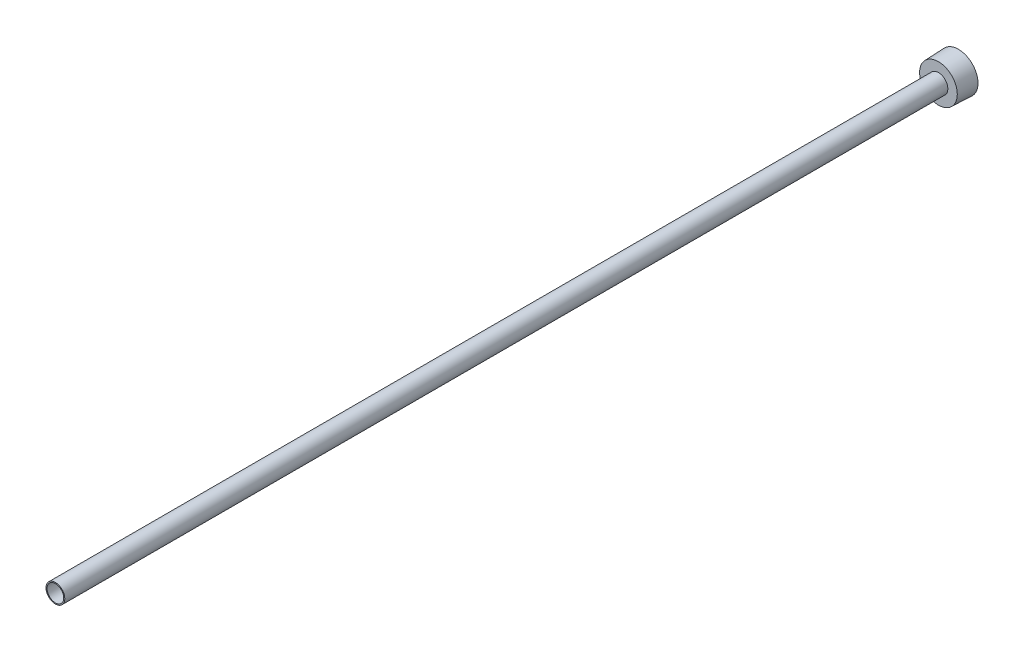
ISO-10303-21;
HEADER;
FILE_DESCRIPTION(('STEP AP214'),'2;1');
FILE_NAME('part.step','',(''),(''),'','','');
FILE_SCHEMA(('AUTOMOTIVE_DESIGN { 1 0 10303 214 1 1 1 1 }'));
ENDSEC;
DATA;
#1=APPLICATION_CONTEXT('core data for automotive mechanical design processes');
#2=APPLICATION_PROTOCOL_DEFINITION('international standard','automotive_design',2000,#1);
#3=PRODUCT_CONTEXT('',#1,'mechanical');
#4=PRODUCT('Part','Part','',(#3));
#5=PRODUCT_RELATED_PRODUCT_CATEGORY('part','',(#4));
#6=PRODUCT_DEFINITION_FORMATION('','',#4);
#7=PRODUCT_DEFINITION_CONTEXT('part definition',#1,'design');
#8=PRODUCT_DEFINITION('design','',#6,#7);
#9=PRODUCT_DEFINITION_SHAPE('','',#8);
#10=(LENGTH_UNIT() NAMED_UNIT(*) SI_UNIT(.MILLI.,.METRE.));
#11=(NAMED_UNIT(*) PLANE_ANGLE_UNIT() SI_UNIT($,.RADIAN.));
#12=(NAMED_UNIT(*) SI_UNIT($,.STERADIAN.) SOLID_ANGLE_UNIT());
#13=UNCERTAINTY_MEASURE_WITH_UNIT(LENGTH_MEASURE(1.E-05),#10,'distance_accuracy_value','');
#14=(GEOMETRIC_REPRESENTATION_CONTEXT(3) GLOBAL_UNCERTAINTY_ASSIGNED_CONTEXT((#13)) GLOBAL_UNIT_ASSIGNED_CONTEXT((#10,
#11,#12)) REPRESENTATION_CONTEXT('',''));
#15=CARTESIAN_POINT('',(0.,0.,0.));
#16=DIRECTION('',(0.,0.,1.));
#17=DIRECTION('',(1.,0.,0.));
#18=AXIS2_PLACEMENT_3D('',#15,#16,#17);
#19=CARTESIAN_POINT('',(0.,0.,0.));
#20=DIRECTION('',(0.,0.,1.));
#21=DIRECTION('',(1.,0.,0.));
#22=AXIS2_PLACEMENT_3D('',#19,#20,#21);
#23=CYLINDRICAL_SURFACE('',#22,5.6388);
#24=CARTESIAN_POINT('',(0.,0.,609.6));
#25=DIRECTION('',(0.,0.,1.));
#26=DIRECTION('',(1.,0.,0.));
#27=AXIS2_PLACEMENT_3D('',#24,#25,#26);
#28=CIRCLE('',#27,5.6388);
#29=CARTESIAN_POINT('',(5.6388,0.,609.6));
#30=VERTEX_POINT('',#29);
#31=EDGE_CURVE('E141',#30,#30,#28,.T.);
#32=CARTESIAN_POINT('',(0.,0.,9.525));
#33=DIRECTION('',(0.,0.,-1.));
#34=DIRECTION('',(-1.,0.,0.));
#35=AXIS2_PLACEMENT_3D('',#32,#33,#34);
#36=CIRCLE('',#35,5.6388);
#37=CARTESIAN_POINT('',(5.6388,0.,9.525));
#38=VERTEX_POINT('',#37);
#39=EDGE_CURVE('E36',#38,#38,#36,.F.);
#40=CARTESIAN_POINT('',(5.6388,0.,609.6));
#41=CARTESIAN_POINT('',(5.6388,0.,603.34921875));
#42=CARTESIAN_POINT('',(5.6388,0.,597.0984375));
#43=CARTESIAN_POINT('',(5.6388,0.,584.596875));
#44=CARTESIAN_POINT('',(5.6388,0.,578.34609375));
#45=CARTESIAN_POINT('',(5.6388,0.,565.84453125));
#46=CARTESIAN_POINT('',(5.6388,0.,559.59375));
#47=CARTESIAN_POINT('',(5.6388,0.,547.0921875));
#48=CARTESIAN_POINT('',(5.6388,0.,540.84140625));
#49=CARTESIAN_POINT('',(5.6388,0.,528.33984375));
#50=CARTESIAN_POINT('',(5.6388,0.,522.0890625));
#51=CARTESIAN_POINT('',(5.6388,0.,509.5875));
#52=CARTESIAN_POINT('',(5.6388,0.,503.33671875));
#53=CARTESIAN_POINT('',(5.6388,0.,490.83515625));
#54=CARTESIAN_POINT('',(5.6388,0.,484.584375));
#55=CARTESIAN_POINT('',(5.6388,0.,472.0828125));
#56=CARTESIAN_POINT('',(5.6388,0.,465.83203125));
#57=CARTESIAN_POINT('',(5.6388,0.,453.33046875));
#58=CARTESIAN_POINT('',(5.6388,0.,447.0796875));
#59=CARTESIAN_POINT('',(5.6388,0.,434.578125));
#60=CARTESIAN_POINT('',(5.6388,0.,428.32734375));
#61=CARTESIAN_POINT('',(5.6388,0.,415.82578125));
#62=CARTESIAN_POINT('',(5.6388,0.,409.575));
#63=CARTESIAN_POINT('',(5.6388,0.,397.0734375));
#64=CARTESIAN_POINT('',(5.6388,0.,390.82265625));
#65=CARTESIAN_POINT('',(5.6388,0.,378.32109375));
#66=CARTESIAN_POINT('',(5.6388,0.,372.0703125));
#67=CARTESIAN_POINT('',(5.6388,0.,359.56875));
#68=CARTESIAN_POINT('',(5.6388,0.,353.31796875));
#69=CARTESIAN_POINT('',(5.6388,0.,340.81640625));
#70=CARTESIAN_POINT('',(5.6388,0.,334.565625));
#71=CARTESIAN_POINT('',(5.6388,0.,322.0640625));
#72=CARTESIAN_POINT('',(5.6388,0.,315.81328125));
#73=CARTESIAN_POINT('',(5.6388,0.,303.31171875));
#74=CARTESIAN_POINT('',(5.6388,0.,297.0609375));
#75=CARTESIAN_POINT('',(5.6388,0.,284.559375));
#76=CARTESIAN_POINT('',(5.6388,0.,278.30859375));
#77=CARTESIAN_POINT('',(5.6388,0.,265.80703125));
#78=CARTESIAN_POINT('',(5.6388,0.,259.55625));
#79=CARTESIAN_POINT('',(5.6388,0.,247.0546875));
#80=CARTESIAN_POINT('',(5.6388,0.,240.80390625));
#81=CARTESIAN_POINT('',(5.6388,0.,228.30234375));
#82=CARTESIAN_POINT('',(5.6388,0.,222.0515625));
#83=CARTESIAN_POINT('',(5.6388,0.,209.55));
#84=CARTESIAN_POINT('',(5.6388,0.,203.29921875));
#85=CARTESIAN_POINT('',(5.6388,0.,190.79765625));
#86=CARTESIAN_POINT('',(5.6388,0.,184.546875));
#87=CARTESIAN_POINT('',(5.6388,0.,172.0453125));
#88=CARTESIAN_POINT('',(5.6388,0.,165.79453125));
#89=CARTESIAN_POINT('',(5.6388,0.,153.29296875));
#90=CARTESIAN_POINT('',(5.6388,0.,147.0421875));
#91=CARTESIAN_POINT('',(5.6388,0.,134.540625));
#92=CARTESIAN_POINT('',(5.6388,0.,128.28984375));
#93=CARTESIAN_POINT('',(5.6388,0.,115.78828125));
#94=CARTESIAN_POINT('',(5.6388,0.,109.5375));
#95=CARTESIAN_POINT('',(5.6388,0.,97.0359375));
#96=CARTESIAN_POINT('',(5.6388,0.,90.78515625));
#97=CARTESIAN_POINT('',(5.6388,0.,78.28359375));
#98=CARTESIAN_POINT('',(5.6388,0.,72.0328125));
#99=CARTESIAN_POINT('',(5.6388,0.,59.53125));
#100=CARTESIAN_POINT('',(5.6388,0.,53.28046875));
#101=CARTESIAN_POINT('',(5.6388,0.,40.77890625));
#102=CARTESIAN_POINT('',(5.6388,0.,34.528125));
#103=CARTESIAN_POINT('',(5.6388,0.,22.0265625));
#104=CARTESIAN_POINT('',(5.6388,0.,15.77578125));
#105=CARTESIAN_POINT('',(5.6388,0.,9.525));
#106=B_SPLINE_CURVE_WITH_KNOTS('',3,(#40,#41,#42,#43,#44,#45,#46,#47,#48,#49,#50,#51,#52,#53,
#54,#55,#56,#57,#58,#59,#60,#61,#62,#63,#64,#65,#66,#67,#68,#69,#70,#71,#72,#73,#74,#75,#76,#77,
#78,#79,#80,#81,#82,#83,#84,#85,#86,#87,#88,#89,#90,#91,#92,#93,#94,#95,#96,#97,#98,#99,#100,
#101,#102,#103,#104,#105),.UNSPECIFIED.,.F.,.F.,(4,2,2,2,2,2,2,2,2,2,2,2,2,2,2,2,2,2,2,2,2,2,2,
2,2,2,2,2,2,2,2,2,4),(0.,18.75234375,37.5046875,56.25703125,75.009375,93.7617187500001,
112.5140625,131.26640625,150.01875,168.77109375,187.5234375,206.27578125,225.028125,
243.78046875,262.5328125,281.28515625,300.0375,318.78984375,337.5421875,356.29453125,375.046875,
393.79921875,412.5515625,431.30390625,450.05625,468.80859375,487.5609375,506.31328125,
525.065625,543.81796875,562.5703125,581.32265625,600.075),.UNSPECIFIED.);
#107=EDGE_CURVE('BSEAM32',#30,#38,#106,.T.);
#108=ORIENTED_EDGE('',*,*,#31,.T.);
#109=ORIENTED_EDGE('',*,*,#39,.F.);
#110=ORIENTED_EDGE('',*,*,#107,.T.);
#111=ORIENTED_EDGE('',*,*,#107,.F.);
#112=EDGE_LOOP('',(#108,#110,#109,#111));
#113=FACE_BOUND('',#112,.T.);
#114=ADVANCED_FACE('F32',(#113),#23,.F.);
#115=CARTESIAN_POINT('',(0.,6.34999999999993,609.6));
#116=DIRECTION('',(0.,0.,-1.));
#117=DIRECTION('',(-1.,0.,0.));
#118=AXIS2_PLACEMENT_3D('',#115,#116,#117);
#119=PLANE('',#118);
#120=ORIENTED_EDGE('',*,*,#31,.F.);
#121=EDGE_LOOP('',(#120));
#122=FACE_BOUND('',#121,.T.);
#123=CARTESIAN_POINT('',(0.,0.,609.6));
#124=DIRECTION('',(0.,0.,1.));
#125=DIRECTION('',(1.,0.,0.));
#126=AXIS2_PLACEMENT_3D('',#123,#124,#125);
#127=CIRCLE('',#126,6.34999999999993);
#128=CARTESIAN_POINT('',(6.34999999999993,0.,609.6));
#129=VERTEX_POINT('',#128);
#130=EDGE_CURVE('E144',#129,#129,#127,.T.);
#131=ORIENTED_EDGE('',*,*,#130,.T.);
#132=EDGE_LOOP('',(#131));
#133=FACE_BOUND('',#132,.T.);
#134=ADVANCED_FACE('F34',(#122,#133),#119,.F.);
#135=CARTESIAN_POINT('',(0.,0.,0.));
#136=DIRECTION('',(0.,0.,1.));
#137=DIRECTION('',(1.,0.,0.));
#138=AXIS2_PLACEMENT_3D('',#135,#136,#137);
#139=PLANE('',#138);
#140=DIRECTION('',(-0.866025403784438,0.5,0.));
#141=VECTOR('',#140,1.);
#142=CARTESIAN_POINT('',(0.,-10.9985226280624,0.));
#143=LINE('',#142,#141);
#144=CARTESIAN_POINT('',(0.,-10.9985226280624,0.));
#145=VERTEX_POINT('',#144);
#146=CARTESIAN_POINT('',(-9.525,-5.49926131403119,0.));
#147=VERTEX_POINT('',#146);
#148=EDGE_CURVE('E123',#145,#147,#143,.T.);
#149=ORIENTED_EDGE('',*,*,#148,.F.);
#150=DIRECTION('',(-0.866025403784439,-0.5,0.));
#151=VECTOR('',#150,1.);
#152=CARTESIAN_POINT('',(9.525,-5.49926131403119,0.));
#153=LINE('',#152,#151);
#154=CARTESIAN_POINT('',(9.525,-5.49926131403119,0.));
#155=VERTEX_POINT('',#154);
#156=EDGE_CURVE('E48',#155,#145,#153,.T.);
#157=ORIENTED_EDGE('',*,*,#156,.F.);
#158=DIRECTION('',(0.,-1.,0.));
#159=VECTOR('',#158,1.);
#160=CARTESIAN_POINT('',(9.525,5.49926131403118,0.));
#161=LINE('',#160,#159);
#162=CARTESIAN_POINT('',(9.525,5.49926131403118,0.));
#163=VERTEX_POINT('',#162);
#164=EDGE_CURVE('E132',#163,#155,#161,.T.);
#165=ORIENTED_EDGE('',*,*,#164,.F.);
#166=DIRECTION('',(0.866025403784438,-0.5,0.));
#167=VECTOR('',#166,1.);
#168=CARTESIAN_POINT('',(0.,10.9985226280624,0.));
#169=LINE('',#168,#167);
#170=CARTESIAN_POINT('',(0.,10.9985226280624,0.));
#171=VERTEX_POINT('',#170);
#172=EDGE_CURVE('E130',#171,#163,#169,.T.);
#173=ORIENTED_EDGE('',*,*,#172,.F.);
#174=DIRECTION('',(0.866025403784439,0.5,0.));
#175=VECTOR('',#174,1.);
#176=CARTESIAN_POINT('',(-9.525,5.49926131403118,0.));
#177=LINE('',#176,#175);
#178=CARTESIAN_POINT('',(-9.525,5.49926131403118,0.));
#179=VERTEX_POINT('',#178);
#180=EDGE_CURVE('E96',#179,#171,#177,.T.);
#181=ORIENTED_EDGE('',*,*,#180,.F.);
#182=DIRECTION('',(0.,1.,0.));
#183=VECTOR('',#182,1.);
#184=CARTESIAN_POINT('',(-9.525,-5.49926131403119,0.));
#185=LINE('',#184,#183);
#186=EDGE_CURVE('E126',#147,#179,#185,.T.);
#187=ORIENTED_EDGE('',*,*,#186,.F.);
#188=EDGE_LOOP('',(#149,#157,#165,#173,#181,#187));
#189=FACE_BOUND('',#188,.T.);
#190=CARTESIAN_POINT('',(0.,0.,0.));
#191=DIRECTION('',(0.,0.,1.));
#192=DIRECTION('',(1.,0.,0.));
#193=AXIS2_PLACEMENT_3D('',#190,#191,#192);
#194=CIRCLE('',#193,13.2207);
#195=CARTESIAN_POINT('',(13.2207,0.,0.));
#196=VERTEX_POINT('',#195);
#197=EDGE_CURVE('E11',#196,#196,#194,.T.);
#198=ORIENTED_EDGE('',*,*,#197,.F.);
#199=EDGE_LOOP('',(#198));
#200=FACE_BOUND('',#199,.T.);
#201=ADVANCED_FACE('F158',(#189,#200),#139,.F.);
#202=CARTESIAN_POINT('',(0.,0.,0.));
#203=DIRECTION('',(0.,0.,-1.));
#204=DIRECTION('',(-1.,0.,0.));
#205=AXIS2_PLACEMENT_3D('',#202,#203,#204);
#206=CONICAL_SURFACE('',#205,13.2207,0.0364599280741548);
#207=CARTESIAN_POINT('',(0.,0.,13.4874));
#208=DIRECTION('',(0.,0.,1.));
#209=DIRECTION('',(1.,0.,0.));
#210=AXIS2_PLACEMENT_3D('',#207,#208,#209);
#211=CIRCLE('',#210,12.7287323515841);
#212=CARTESIAN_POINT('',(12.7287323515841,0.,13.4874));
#213=VERTEX_POINT('',#212);
#214=EDGE_CURVE('E41',#213,#213,#211,.T.);
#215=ORIENTED_EDGE('',*,*,#214,.F.);
#216=EDGE_LOOP('',(#215));
#217=FACE_BOUND('',#216,.T.);
#218=ORIENTED_EDGE('',*,*,#197,.T.);
#219=EDGE_LOOP('',(#218));
#220=FACE_BOUND('',#219,.T.);
#221=ADVANCED_FACE('F155',(#217,#220),#206,.T.);
#222=CARTESIAN_POINT('',(0.,12.7287323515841,13.4874));
#223=DIRECTION('',(0.,0.,-1.));
#224=DIRECTION('',(-1.,0.,0.));
#225=AXIS2_PLACEMENT_3D('',#222,#223,#224);
#226=PLANE('',#225);
#227=CARTESIAN_POINT('',(0.,0.,13.4874));
#228=DIRECTION('',(0.,0.,1.));
#229=DIRECTION('',(1.,0.,0.));
#230=AXIS2_PLACEMENT_3D('',#227,#228,#229);
#231=CIRCLE('',#230,6.35);
#232=CARTESIAN_POINT('',(6.35,0.,13.4874));
#233=VERTEX_POINT('',#232);
#234=EDGE_CURVE('E147',#233,#233,#231,.T.);
#235=ORIENTED_EDGE('',*,*,#234,.F.);
#236=EDGE_LOOP('',(#235));
#237=FACE_BOUND('',#236,.T.);
#238=ORIENTED_EDGE('',*,*,#214,.T.);
#239=EDGE_LOOP('',(#238));
#240=FACE_BOUND('',#239,.T.);
#241=ADVANCED_FACE('F153',(#237,#240),#226,.F.);
#242=CARTESIAN_POINT('',(0.,0.,278.00111462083));
#243=DIRECTION('',(0.,0.,1.));
#244=DIRECTION('',(1.,0.,0.));
#245=AXIS2_PLACEMENT_3D('',#242,#243,#244);
#246=CYLINDRICAL_SURFACE('',#245,6.34999999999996);
#247=ORIENTED_EDGE('',*,*,#130,.F.);
#248=EDGE_LOOP('',(#247));
#249=FACE_BOUND('',#248,.T.);
#250=ORIENTED_EDGE('',*,*,#234,.T.);
#251=EDGE_LOOP('',(#250));
#252=FACE_BOUND('',#251,.T.);
#253=ADVANCED_FACE('F179',(#249,#252),#246,.T.);
#254=CARTESIAN_POINT('',(0.,-10.9985226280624,9.525));
#255=DIRECTION('',(0.,0.,-1.));
#256=DIRECTION('',(-1.,0.,0.));
#257=AXIS2_PLACEMENT_3D('',#254,#255,#256);
#258=PLANE('',#257);
#259=DIRECTION('',(-0.866025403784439,-0.5,0.));
#260=VECTOR('',#259,1.);
#261=CARTESIAN_POINT('',(9.525,-5.49926131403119,9.525));
#262=LINE('',#261,#260);
#263=CARTESIAN_POINT('',(9.525,-5.49926131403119,9.525));
#264=VERTEX_POINT('',#263);
#265=CARTESIAN_POINT('',(0.,-10.9985226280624,9.525));
#266=VERTEX_POINT('',#265);
#267=EDGE_CURVE('E134',#264,#266,#262,.T.);
#268=ORIENTED_EDGE('',*,*,#267,.T.);
#269=DIRECTION('',(-0.866025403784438,0.5,0.));
#270=VECTOR('',#269,1.);
#271=CARTESIAN_POINT('',(0.,-10.9985226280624,9.525));
#272=LINE('',#271,#270);
#273=CARTESIAN_POINT('',(-9.525,-5.49926131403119,9.525));
#274=VERTEX_POINT('',#273);
#275=EDGE_CURVE('E117',#266,#274,#272,.T.);
#276=ORIENTED_EDGE('',*,*,#275,.T.);
#277=DIRECTION('',(0.,1.,0.));
#278=VECTOR('',#277,1.);
#279=CARTESIAN_POINT('',(-9.525,-5.49926131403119,9.525));
#280=LINE('',#279,#278);
#281=CARTESIAN_POINT('',(-9.525,5.49926131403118,9.525));
#282=VERTEX_POINT('',#281);
#283=EDGE_CURVE('E115',#274,#282,#280,.T.);
#284=ORIENTED_EDGE('',*,*,#283,.T.);
#285=DIRECTION('',(0.866025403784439,0.5,0.));
#286=VECTOR('',#285,1.);
#287=CARTESIAN_POINT('',(-9.525,5.49926131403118,9.525));
#288=LINE('',#287,#286);
#289=CARTESIAN_POINT('',(0.,10.9985226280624,9.525));
#290=VERTEX_POINT('',#289);
#291=EDGE_CURVE('E93',#282,#290,#288,.T.);
#292=ORIENTED_EDGE('',*,*,#291,.T.);
#293=DIRECTION('',(0.866025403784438,-0.5,0.));
#294=VECTOR('',#293,1.);
#295=CARTESIAN_POINT('',(0.,10.9985226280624,9.525));
#296=LINE('',#295,#294);
#297=CARTESIAN_POINT('',(9.525,5.49926131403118,9.525));
#298=VERTEX_POINT('',#297);
#299=EDGE_CURVE('E104',#290,#298,#296,.T.);
#300=ORIENTED_EDGE('',*,*,#299,.T.);
#301=DIRECTION('',(0.,-1.,0.));
#302=VECTOR('',#301,1.);
#303=CARTESIAN_POINT('',(9.525,5.49926131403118,9.525));
#304=LINE('',#303,#302);
#305=EDGE_CURVE('E108',#298,#264,#304,.T.);
#306=ORIENTED_EDGE('',*,*,#305,.T.);
#307=EDGE_LOOP('',(#268,#276,#284,#292,#300,#306));
#308=FACE_BOUND('',#307,.T.);
#309=ORIENTED_EDGE('',*,*,#39,.T.);
#310=EDGE_LOOP('',(#309));
#311=FACE_BOUND('',#310,.T.);
#312=ADVANCED_FACE('F111',(#308,#311),#258,.T.);
#313=CARTESIAN_POINT('',(9.525,-5.49926131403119,9.525));
#314=DIRECTION('',(0.5,-0.866025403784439,0.));
#315=DIRECTION('',(0.866025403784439,0.5,0.));
#316=AXIS2_PLACEMENT_3D('',#313,#314,#315);
#317=PLANE('',#316);
#318=ORIENTED_EDGE('',*,*,#156,.T.);
#319=DIRECTION('',(0.,0.,-1.));
#320=VECTOR('',#319,1.);
#321=CARTESIAN_POINT('',(0.,-10.9985226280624,9.525));
#322=LINE('',#321,#320);
#323=EDGE_CURVE('E78',#266,#145,#322,.T.);
#324=ORIENTED_EDGE('',*,*,#323,.F.);
#325=ORIENTED_EDGE('',*,*,#267,.F.);
#326=DIRECTION('',(0.,0.,-1.));
#327=VECTOR('',#326,1.);
#328=CARTESIAN_POINT('',(9.525,-5.49926131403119,9.525));
#329=LINE('',#328,#327);
#330=EDGE_CURVE('E56',#264,#155,#329,.T.);
#331=ORIENTED_EDGE('',*,*,#330,.T.);
#332=EDGE_LOOP('',(#318,#324,#325,#331));
#333=FACE_BOUND('',#332,.T.);
#334=ADVANCED_FACE('F177',(#333),#317,.F.);
#335=CARTESIAN_POINT('',(9.525,5.49926131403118,9.525));
#336=DIRECTION('',(1.,0.,0.));
#337=DIRECTION('',(0.,0.,-1.));
#338=AXIS2_PLACEMENT_3D('',#335,#336,#337);
#339=PLANE('',#338);
#340=ORIENTED_EDGE('',*,*,#164,.T.);
#341=ORIENTED_EDGE('',*,*,#330,.F.);
#342=ORIENTED_EDGE('',*,*,#305,.F.);
#343=DIRECTION('',(0.,0.,-1.));
#344=VECTOR('',#343,1.);
#345=CARTESIAN_POINT('',(9.525,5.49926131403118,9.525));
#346=LINE('',#345,#344);
#347=EDGE_CURVE('E100',#298,#163,#346,.T.);
#348=ORIENTED_EDGE('',*,*,#347,.T.);
#349=EDGE_LOOP('',(#340,#341,#342,#348));
#350=FACE_BOUND('',#349,.T.);
#351=ADVANCED_FACE('F208',(#350),#339,.F.);
#352=CARTESIAN_POINT('',(0.,10.9985226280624,9.525));
#353=DIRECTION('',(0.5,0.866025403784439,0.));
#354=DIRECTION('',(-0.866025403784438,0.5,0.));
#355=AXIS2_PLACEMENT_3D('',#352,#353,#354);
#356=PLANE('',#355);
#357=ORIENTED_EDGE('',*,*,#172,.T.);
#358=ORIENTED_EDGE('',*,*,#347,.F.);
#359=ORIENTED_EDGE('',*,*,#299,.F.);
#360=DIRECTION('',(0.,0.,-1.));
#361=VECTOR('',#360,1.);
#362=CARTESIAN_POINT('',(0.,10.9985226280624,9.525));
#363=LINE('',#362,#361);
#364=EDGE_CURVE('E89',#290,#171,#363,.T.);
#365=ORIENTED_EDGE('',*,*,#364,.T.);
#366=EDGE_LOOP('',(#357,#358,#359,#365));
#367=FACE_BOUND('',#366,.T.);
#368=ADVANCED_FACE('F105',(#367),#356,.F.);
#369=CARTESIAN_POINT('',(-9.525,5.49926131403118,9.525));
#370=DIRECTION('',(-0.5,0.866025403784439,0.));
#371=DIRECTION('',(-0.866025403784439,-0.5,0.));
#372=AXIS2_PLACEMENT_3D('',#369,#370,#371);
#373=PLANE('',#372);
#374=ORIENTED_EDGE('',*,*,#180,.T.);
#375=ORIENTED_EDGE('',*,*,#364,.F.);
#376=ORIENTED_EDGE('',*,*,#291,.F.);
#377=DIRECTION('',(0.,0.,-1.));
#378=VECTOR('',#377,1.);
#379=CARTESIAN_POINT('',(-9.525,5.49926131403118,9.525));
#380=LINE('',#379,#378);
#381=EDGE_CURVE('E101',#282,#179,#380,.T.);
#382=ORIENTED_EDGE('',*,*,#381,.T.);
#383=EDGE_LOOP('',(#374,#375,#376,#382));
#384=FACE_BOUND('',#383,.T.);
#385=ADVANCED_FACE('F91',(#384),#373,.F.);
#386=CARTESIAN_POINT('',(-9.525,-5.49926131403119,9.525));
#387=DIRECTION('',(-1.,0.,0.));
#388=DIRECTION('',(0.,0.,1.));
#389=AXIS2_PLACEMENT_3D('',#386,#387,#388);
#390=PLANE('',#389);
#391=ORIENTED_EDGE('',*,*,#186,.T.);
#392=ORIENTED_EDGE('',*,*,#381,.F.);
#393=ORIENTED_EDGE('',*,*,#283,.F.);
#394=DIRECTION('',(0.,0.,-1.));
#395=VECTOR('',#394,1.);
#396=CARTESIAN_POINT('',(-9.525,-5.49926131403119,9.525));
#397=LINE('',#396,#395);
#398=EDGE_CURVE('E138',#274,#147,#397,.T.);
#399=ORIENTED_EDGE('',*,*,#398,.T.);
#400=EDGE_LOOP('',(#391,#392,#393,#399));
#401=FACE_BOUND('',#400,.T.);
#402=ADVANCED_FACE('F226',(#401),#390,.F.);
#403=CARTESIAN_POINT('',(0.,-10.9985226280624,9.525));
#404=DIRECTION('',(-0.5,-0.866025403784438,0.));
#405=DIRECTION('',(0.866025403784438,-0.5,0.));
#406=AXIS2_PLACEMENT_3D('',#403,#404,#405);
#407=PLANE('',#406);
#408=ORIENTED_EDGE('',*,*,#148,.T.);
#409=ORIENTED_EDGE('',*,*,#398,.F.);
#410=ORIENTED_EDGE('',*,*,#275,.F.);
#411=ORIENTED_EDGE('',*,*,#323,.T.);
#412=EDGE_LOOP('',(#408,#409,#410,#411));
#413=FACE_BOUND('',#412,.T.);
#414=ADVANCED_FACE('F233',(#413),#407,.F.);
#415=CLOSED_SHELL('',(#114,#134,#201,#221,#241,#253,#312,#334,#351,#368,#385,#402,#414));
#416=MANIFOLD_SOLID_BREP('B2',#415);
#417=ADVANCED_BREP_SHAPE_REPRESENTATION('',(#18,#416),#14);
#418=SHAPE_DEFINITION_REPRESENTATION(#9,#417);
ENDSEC;
END-ISO-10303-21;
